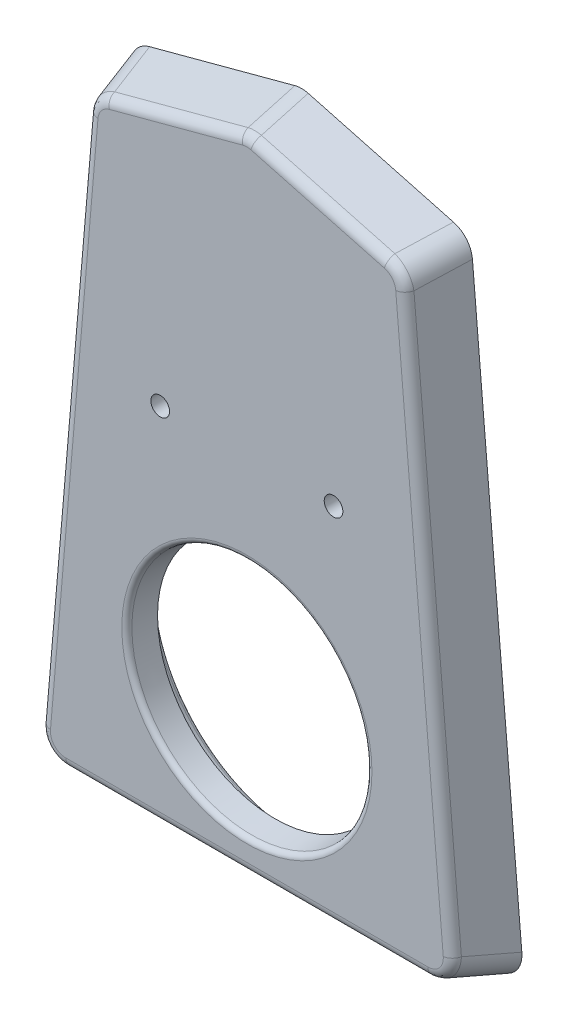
from build123d import *

# Parameters (mm, degrees)
BASE_EXTRUSION_DEPTH              = 20.5
BASE_EXTRUSION_TAPER              = 15
ESQUISSE2_R                       = 54.5
ENL_V_MAT_EXTRU_1_DEPTH           = 10
ENL_V_MAT_EXTRU_1_DRAFT           = -9
ESQUISSE3_R                       = 44
ENL_V_MAT_EXTRU_2_DEPTH           = 264.784950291
ENL_V_MAT_EXTRU_2_DRAFT           = 6
ESQUISSE4_R                       = 55
ENL_V_MAT_EXTRU_3_DEPTH           = 1.5
ENL_V_MAT_EXTRU_3_DRAFT           = -5
ESQUISSE5_R                       = 1.7
ENL_V_MAT_EXTRU_4_DEPTH           = 15
ENL_V_MAT_EXTRU_4_DRAFT           = -1
ENL_V_MAT_EXTRU_4_PROFILE_2_DEPTH = 15
ENL_V_MAT_EXTRU_4_PROFILE_2_DRAFT = -1
ENL_V_MAT_EXTRU_4_PROFILE_3_DEPTH = 15
ENL_V_MAT_EXTRU_4_PROFILE_3_DRAFT = -1
ENL_V_MAT_EXTRU_4_PROFILE_4_DEPTH = 15
ENL_V_MAT_EXTRU_4_PROFILE_4_DRAFT = -1
CONG_5_R                          = 10
CONG_6_R                          = 4
CONG_7_R                          = 2
CONG_8_R                          = 1
ESQUISSE6_R                       = 3.5
ENL_V_MAT_EXTRU_5_DEPTH           = 264.666389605
CONG_11_R                         = 0.5


with BuildPart() as part:
    # Esquisse1 → Base-Extrusion (new body)
    with BuildSketch(Plane.XY):
        Polygon((0, 0), (83.5, 0), (63.5, 232.985226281), (0, 250), (-63.5, 232.985226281), (-83.5, 0), align=None)
    extrude(amount=BASE_EXTRUSION_DEPTH, taper=BASE_EXTRUSION_TAPER)


with BuildPart() as enl_v_mat_extru_1_tool:
    # Esquisse2 → Enl_v. mat.-Extru.1 (with draft: the straight prism first)
    with BuildSketch(Plane(origin=(0, 0, 0), x_dir=(-1, 0, 0), z_dir=(0, 0, -1))):
        with Locations((0, 61.5)):
            Circle(ESQUISSE2_R)
    extrude(amount=-ENL_V_MAT_EXTRU_1_DEPTH)
    # Enl_v. mat.-Extru.1: the draft: its side faces are tilted about the plane it starts from
    enl_v_mat_extru_1_sides = [enl_v_mat_extru_1_tool.faces().sort_by_distance(p)[0] for p in [
        (54.5, 61.5, 5),
    ]]
    draft(enl_v_mat_extru_1_sides, Plane(origin=(0, 0, 0), x_dir=(-1, 0, 0), z_dir=(0, 0, -1)), ENL_V_MAT_EXTRU_1_DRAFT)


with BuildPart() as part_1:
    add(part.part)

    # Enl_v. mat.-Extru.1: cut by enl_v_mat_extru_1_tool
    add(enl_v_mat_extru_1_tool.part, mode=Mode.SUBTRACT)


with BuildPart() as enl_v_mat_extru_2_tool:
    # Esquisse3 → Enl_v. mat.-Extru.2 (with draft: the straight prism first)
    with BuildSketch(Plane(origin=(0, 0, 10), x_dir=(-1, 0, 0), z_dir=(0, 0, -1))):
        with Locations((0, 61.5)):
            Circle(ESQUISSE3_R)
    extrude(amount=-ENL_V_MAT_EXTRU_2_DEPTH)
    # Enl_v. mat.-Extru.2: the draft: its side faces are tilted about the plane it starts from
    enl_v_mat_extru_2_sides = [enl_v_mat_extru_2_tool.faces().sort_by_distance(p)[0] for p in [
        (44, 61.5, 142.392475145),
    ]]
    draft(enl_v_mat_extru_2_sides, Plane(origin=(0, 0, 10), x_dir=(-1, 0, 0), z_dir=(0, 0, -1)), ENL_V_MAT_EXTRU_2_DRAFT)


with BuildPart() as part_2:
    add(part_1.part)

    # Enl_v. mat.-Extru.2: cut by enl_v_mat_extru_2_tool
    add(enl_v_mat_extru_2_tool.part, mode=Mode.SUBTRACT)


with BuildPart() as enl_v_mat_extru_3_tool:
    # Esquisse4 → Enl_v. mat.-Extru.3 (with draft: the straight prism first)
    with BuildSketch(Plane(origin=(0, 0, 0), x_dir=(-1, 0, 0), z_dir=(0, 0, -1))):
        with Locations((0, 176)):
            Circle(ESQUISSE4_R)
    extrude(amount=-ENL_V_MAT_EXTRU_3_DEPTH)
    # Enl_v. mat.-Extru.3: the draft: its side faces are tilted about the plane it starts from
    enl_v_mat_extru_3_sides = [enl_v_mat_extru_3_tool.faces().sort_by_distance(p)[0] for p in [
        (55, 176, 0.75),
    ]]
    draft(enl_v_mat_extru_3_sides, Plane(origin=(0, 0, 0), x_dir=(-1, 0, 0), z_dir=(0, 0, -1)), ENL_V_MAT_EXTRU_3_DRAFT)


with BuildPart() as part_3:
    add(part_2.part)

    # Enl_v. mat.-Extru.3: cut by enl_v_mat_extru_3_tool
    add(enl_v_mat_extru_3_tool.part, mode=Mode.SUBTRACT)


with BuildPart() as enl_v_mat_extru_4_tool:
    # Esquisse5 → Enl_v. mat.-Extru.4 (with draft: the straight prism first)
    with BuildSketch(Plane(origin=(0, 0, 0), x_dir=(-1, 0, 0), z_dir=(0, 0, -1))):
        with Locations((66.5, 15)):
            Circle(ESQUISSE5_R)
    extrude(amount=-ENL_V_MAT_EXTRU_4_DEPTH)
    # Enl_v. mat.-Extru.4: the draft: its side faces are tilted about the plane it starts from
    enl_v_mat_extru_4_sides = [enl_v_mat_extru_4_tool.faces().sort_by_distance(p)[0] for p in [
        (-64.8, 15, 7.5),
    ]]
    draft(enl_v_mat_extru_4_sides, Plane(origin=(0, 0, 0), x_dir=(-1, 0, 0), z_dir=(0, 0, -1)), ENL_V_MAT_EXTRU_4_DRAFT)


with BuildPart() as part_4:
    add(part_3.part)

    # Enl_v. mat.-Extru.4: cut by enl_v_mat_extru_4_tool
    add(enl_v_mat_extru_4_tool.part, mode=Mode.SUBTRACT)


with BuildPart() as enl_v_mat_extru_4_profile_2_tool:
    # Esquisse5 → Enl_v. mat.-Extru.4 profile 2 (with draft: the straight prism first)
    with BuildSketch(Plane(origin=(0, 0, 0), x_dir=(-1, 0, 0), z_dir=(0, 0, -1))):
        with Locations((52.4, 222.4)):
            Circle(ESQUISSE5_R)
    extrude(amount=-ENL_V_MAT_EXTRU_4_PROFILE_2_DEPTH)
    # Enl_v. mat.-Extru.4 profile 2: the draft: its side faces are tilted about the plane it starts from
    enl_v_mat_extru_4_profile_2_sides = [enl_v_mat_extru_4_profile_2_tool.faces().sort_by_distance(p)[0] for p in [
        (-50.7, 222.4, 7.5),
    ]]
    draft(enl_v_mat_extru_4_profile_2_sides, Plane(origin=(0, 0, 0), x_dir=(-1, 0, 0), z_dir=(0, 0, -1)), ENL_V_MAT_EXTRU_4_PROFILE_2_DRAFT)


with BuildPart() as part_5:
    add(part_4.part)

    # Enl_v. mat.-Extru.4 profile 2: cut by enl_v_mat_extru_4_profile_2_tool
    add(enl_v_mat_extru_4_profile_2_tool.part, mode=Mode.SUBTRACT)


with BuildPart() as enl_v_mat_extru_4_profile_3_tool:
    # Esquisse5 → Enl_v. mat.-Extru.4 profile 3 (with draft: the straight prism first)
    with BuildSketch(Plane(origin=(0, 0, 0), x_dir=(-1, 0, 0), z_dir=(0, 0, -1))):
        with Locations((-52.4, 222.4)):
            Circle(ESQUISSE5_R)
    extrude(amount=-ENL_V_MAT_EXTRU_4_PROFILE_3_DEPTH)
    # Enl_v. mat.-Extru.4 profile 3: the draft: its side faces are tilted about the plane it starts from
    enl_v_mat_extru_4_profile_3_sides = [enl_v_mat_extru_4_profile_3_tool.faces().sort_by_distance(p)[0] for p in [
        (54.1, 222.4, 7.5),
    ]]
    draft(enl_v_mat_extru_4_profile_3_sides, Plane(origin=(0, 0, 0), x_dir=(-1, 0, 0), z_dir=(0, 0, -1)), ENL_V_MAT_EXTRU_4_PROFILE_3_DRAFT)


with BuildPart() as part_6:
    add(part_5.part)

    # Enl_v. mat.-Extru.4 profile 3: cut by enl_v_mat_extru_4_profile_3_tool
    add(enl_v_mat_extru_4_profile_3_tool.part, mode=Mode.SUBTRACT)


with BuildPart() as enl_v_mat_extru_4_profile_4_tool:
    # Esquisse5 → Enl_v. mat.-Extru.4 profile 4 (with draft: the straight prism first)
    with BuildSketch(Plane(origin=(0, 0, 0), x_dir=(-1, 0, 0), z_dir=(0, 0, -1))):
        with Locations((-66.5, 15)):
            Circle(ESQUISSE5_R)
    extrude(amount=-ENL_V_MAT_EXTRU_4_PROFILE_4_DEPTH)
    # Enl_v. mat.-Extru.4 profile 4: the draft: its side faces are tilted about the plane it starts from
    enl_v_mat_extru_4_profile_4_sides = [enl_v_mat_extru_4_profile_4_tool.faces().sort_by_distance(p)[0] for p in [
        (68.2, 15, 7.5),
    ]]
    draft(enl_v_mat_extru_4_profile_4_sides, Plane(origin=(0, 0, 0), x_dir=(-1, 0, 0), z_dir=(0, 0, -1)), ENL_V_MAT_EXTRU_4_PROFILE_4_DRAFT)


with BuildPart() as part_7:
    add(part_6.part)

    # Enl_v. mat.-Extru.4 profile 4: cut by enl_v_mat_extru_4_profile_4_tool
    add(enl_v_mat_extru_4_profile_4_tool.part, mode=Mode.SUBTRACT)

    # Cong_5
    cong_5_edges = [part_7.edges().sort_by_distance(p)[0] for p in [
        (-60.928349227, 230.83093305, 10.250001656),
        (0, 247.156635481, 10.25),
        (60.928349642, 230.830933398, 10.25),
        (80.507655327, 2.746479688, 10.250001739),
        (-80.507655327, 2.746479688, 10.250001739),
    ]]
    fillet(cong_5_edges, radius=CONG_5_R)

    # Cong_6
    cong_6_edges = [part_7.edges().sort_by_distance(p)[0] for p in [
        (-27.156153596, 237.036801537, 20.5),
        (27.156153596, 237.036801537, 20.5),
        (0, 5.492958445, 20.5),
        (67.775696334, 118.952282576, 20.5),
        (-67.775696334, 118.952282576, 20.5),
        (-74.160355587, 8.572255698, 20.5),
        (74.160355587, 8.572255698, 20.5),
        (56.728776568, 227.312916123, 20.5),
        (-56.728776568, 227.312916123, 20.5),
        (0, 243.972930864, 20.5),
    ]]
    fillet(cong_6_edges, radius=CONG_6_R)

    # Cong_7
    cong_7_edges = [part_7.edges().sort_by_distance(p)[0] for p in [
        (52.916155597, 61.5, 10),
        (54.5, 61.5, 0),
        (45.10359447, 61.5, 20.5),
    ]]
    fillet(cong_7_edges, radius=CONG_7_R)

    # Cong_8
    cong_8_edges = [part_7.edges().sort_by_distance(p)[0] for p in [
        (54.868767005, 176, 1.5),
    ]]
    fillet(cong_8_edges, radius=CONG_8_R)

    # Esquisse6 → Enl_v. mat.-Extru.5 (cut, through all)
    with BuildSketch(Plane(origin=(0, 0, 1.5), x_dir=(-1, 0, 0), z_dir=(0, 0, -1))):
        with Locations((-32.5, 140.5)):
            Circle(ESQUISSE6_R)
        with Locations(Location((32.5, 140.5, 0), (0, 0, 180))):
            Circle(ESQUISSE6_R)
    extrude(amount=-ENL_V_MAT_EXTRU_5_DEPTH, mode=Mode.SUBTRACT)

    # Cong_11
    cong_11_edges = [part_7.edges().sort_by_distance(p)[0] for p in [
        (55, 176, 0),
    ]]
    fillet(cong_11_edges, radius=CONG_11_R)


solid = part_7.part
